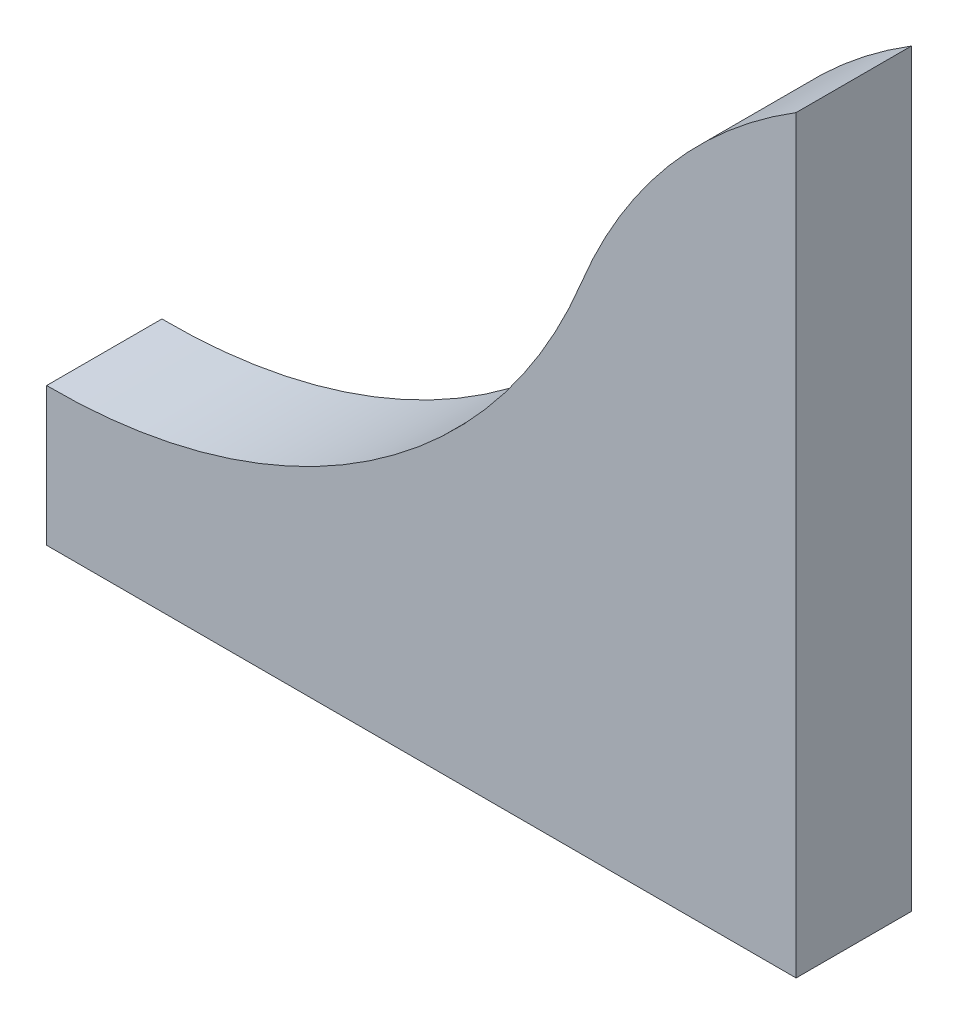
ISO-10303-21;
HEADER;
FILE_DESCRIPTION(('STEP AP214'),'2;1');
FILE_NAME('part.step','',(''),(''),'','','');
FILE_SCHEMA(('AUTOMOTIVE_DESIGN { 1 0 10303 214 1 1 1 1 }'));
ENDSEC;
DATA;
#1=APPLICATION_CONTEXT('core data for automotive mechanical design processes');
#2=APPLICATION_PROTOCOL_DEFINITION('international standard','automotive_design',2000,#1);
#3=PRODUCT_CONTEXT('',#1,'mechanical');
#4=PRODUCT('Part','Part','',(#3));
#5=PRODUCT_RELATED_PRODUCT_CATEGORY('part','',(#4));
#6=PRODUCT_DEFINITION_FORMATION('','',#4);
#7=PRODUCT_DEFINITION_CONTEXT('part definition',#1,'design');
#8=PRODUCT_DEFINITION('design','',#6,#7);
#9=PRODUCT_DEFINITION_SHAPE('','',#8);
#10=(LENGTH_UNIT() NAMED_UNIT(*) SI_UNIT(.MILLI.,.METRE.));
#11=(NAMED_UNIT(*) PLANE_ANGLE_UNIT() SI_UNIT($,.RADIAN.));
#12=(NAMED_UNIT(*) SI_UNIT($,.STERADIAN.) SOLID_ANGLE_UNIT());
#13=UNCERTAINTY_MEASURE_WITH_UNIT(LENGTH_MEASURE(1.E-05),#10,'distance_accuracy_value','');
#14=(GEOMETRIC_REPRESENTATION_CONTEXT(3) GLOBAL_UNCERTAINTY_ASSIGNED_CONTEXT((#13)) GLOBAL_UNIT_ASSIGNED_CONTEXT((#10,
#11,#12)) REPRESENTATION_CONTEXT('',''));
#15=CARTESIAN_POINT('',(0.,0.,0.));
#16=DIRECTION('',(0.,0.,1.));
#17=DIRECTION('',(1.,0.,0.));
#18=AXIS2_PLACEMENT_3D('',#15,#16,#17);
#19=CARTESIAN_POINT('',(-65.,0.,10.));
#20=DIRECTION('',(1.,0.,0.));
#21=DIRECTION('',(0.,0.,-1.));
#22=AXIS2_PLACEMENT_3D('',#19,#20,#21);
#23=PLANE('',#22);
#24=DIRECTION('',(0.,-1.,0.));
#25=VECTOR('',#24,1.);
#26=CARTESIAN_POINT('',(-65.,0.,0.));
#27=LINE('',#26,#25);
#28=CARTESIAN_POINT('',(-65.,12.0002642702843,0.));
#29=VERTEX_POINT('',#28);
#30=CARTESIAN_POINT('',(-65.,0.,0.));
#31=VERTEX_POINT('',#30);
#32=EDGE_CURVE('E104',#29,#31,#27,.T.);
#33=ORIENTED_EDGE('',*,*,#32,.T.);
#34=DIRECTION('',(0.,0.,-1.));
#35=VECTOR('',#34,1.);
#36=CARTESIAN_POINT('',(-65.,0.,10.));
#37=LINE('',#36,#35);
#38=CARTESIAN_POINT('',(-65.,0.,10.));
#39=VERTEX_POINT('',#38);
#40=EDGE_CURVE('E11',#39,#31,#37,.T.);
#41=ORIENTED_EDGE('',*,*,#40,.F.);
#42=DIRECTION('',(0.,-1.,0.));
#43=VECTOR('',#42,1.);
#44=CARTESIAN_POINT('',(-65.,0.,10.));
#45=LINE('',#44,#43);
#46=CARTESIAN_POINT('',(-65.,12.0002642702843,10.));
#47=VERTEX_POINT('',#46);
#48=EDGE_CURVE('E112',#47,#39,#45,.T.);
#49=ORIENTED_EDGE('',*,*,#48,.F.);
#50=DIRECTION('',(0.,0.,-1.));
#51=VECTOR('',#50,1.);
#52=CARTESIAN_POINT('',(-65.,12.0002642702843,10.));
#53=LINE('',#52,#51);
#54=EDGE_CURVE('E100',#47,#29,#53,.T.);
#55=ORIENTED_EDGE('',*,*,#54,.T.);
#56=EDGE_LOOP('',(#33,#41,#49,#55));
#57=FACE_BOUND('',#56,.T.);
#58=ADVANCED_FACE('F30',(#57),#23,.F.);
#59=CARTESIAN_POINT('',(-65.,0.,10.));
#60=DIRECTION('',(0.,1.,0.));
#61=DIRECTION('',(0.,0.,1.));
#62=AXIS2_PLACEMENT_3D('',#59,#60,#61);
#63=PLANE('',#62);
#64=DIRECTION('',(1.,0.,0.));
#65=VECTOR('',#64,1.);
#66=CARTESIAN_POINT('',(-65.,0.,0.));
#67=LINE('',#66,#65);
#68=CARTESIAN_POINT('',(0.,0.,0.));
#69=VERTEX_POINT('',#68);
#70=EDGE_CURVE('E107',#31,#69,#67,.T.);
#71=ORIENTED_EDGE('',*,*,#70,.T.);
#72=DIRECTION('',(0.,0.,-1.));
#73=VECTOR('',#72,1.);
#74=CARTESIAN_POINT('',(0.,0.,10.));
#75=LINE('',#74,#73);
#76=CARTESIAN_POINT('',(0.,0.,10.));
#77=VERTEX_POINT('',#76);
#78=EDGE_CURVE('E38',#77,#69,#75,.T.);
#79=ORIENTED_EDGE('',*,*,#78,.F.);
#80=DIRECTION('',(1.,0.,0.));
#81=VECTOR('',#80,1.);
#82=CARTESIAN_POINT('',(-65.,0.,10.));
#83=LINE('',#82,#81);
#84=EDGE_CURVE('E80',#39,#77,#83,.T.);
#85=ORIENTED_EDGE('',*,*,#84,.F.);
#86=ORIENTED_EDGE('',*,*,#40,.T.);
#87=EDGE_LOOP('',(#71,#79,#85,#86));
#88=FACE_BOUND('',#87,.T.);
#89=ADVANCED_FACE('F131',(#88),#63,.F.);
#90=CARTESIAN_POINT('',(0.,0.,10.));
#91=DIRECTION('',(-1.,0.,0.));
#92=DIRECTION('',(0.,0.,1.));
#93=AXIS2_PLACEMENT_3D('',#90,#91,#92);
#94=PLANE('',#93);
#95=DIRECTION('',(0.,1.,0.));
#96=VECTOR('',#95,1.);
#97=CARTESIAN_POINT('',(0.,0.,0.));
#98=LINE('',#97,#96);
#99=CARTESIAN_POINT('',(0.,65.,0.));
#100=VERTEX_POINT('',#99);
#101=EDGE_CURVE('E95',#69,#100,#98,.T.);
#102=ORIENTED_EDGE('',*,*,#101,.T.);
#103=DIRECTION('',(0.,0.,-1.));
#104=VECTOR('',#103,1.);
#105=CARTESIAN_POINT('',(0.,65.,10.));
#106=LINE('',#105,#104);
#107=CARTESIAN_POINT('',(0.,65.,10.));
#108=VERTEX_POINT('',#107);
#109=EDGE_CURVE('E92',#108,#100,#106,.T.);
#110=ORIENTED_EDGE('',*,*,#109,.F.);
#111=DIRECTION('',(0.,1.,0.));
#112=VECTOR('',#111,1.);
#113=CARTESIAN_POINT('',(0.,0.,10.));
#114=LINE('',#113,#112);
#115=EDGE_CURVE('E84',#77,#108,#114,.T.);
#116=ORIENTED_EDGE('',*,*,#115,.F.);
#117=ORIENTED_EDGE('',*,*,#78,.T.);
#118=EDGE_LOOP('',(#102,#110,#116,#117));
#119=FACE_BOUND('',#118,.T.);
#120=ADVANCED_FACE('F93',(#119),#94,.F.);
#121=CARTESIAN_POINT('',(24.3407578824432,25.5896375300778,10.));
#122=DIRECTION('',(0.,0.,-1.));
#123=DIRECTION('',(-1.,0.,0.));
#124=AXIS2_PLACEMENT_3D('',#121,#122,#123);
#125=CYLINDRICAL_SURFACE('',#124,46.3211524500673);
#126=CARTESIAN_POINT('',(24.3407578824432,25.5896375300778,0.));
#127=DIRECTION('',(0.,0.,1.));
#128=DIRECTION('',(1.,0.,0.));
#129=AXIS2_PLACEMENT_3D('',#126,#127,#128);
#130=CIRCLE('',#129,46.3211524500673);
#131=CARTESIAN_POINT('',(-18.6021503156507,42.9549995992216,0.));
#132=VERTEX_POINT('',#131);
#133=EDGE_CURVE('E66',#100,#132,#130,.T.);
#134=ORIENTED_EDGE('',*,*,#133,.T.);
#135=DIRECTION('',(0.,0.,-1.));
#136=VECTOR('',#135,1.);
#137=CARTESIAN_POINT('',(-18.6021503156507,42.9549995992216,10.));
#138=LINE('',#137,#136);
#139=CARTESIAN_POINT('',(-18.6021503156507,42.9549995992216,10.));
#140=VERTEX_POINT('',#139);
#141=EDGE_CURVE('E96',#140,#132,#138,.T.);
#142=ORIENTED_EDGE('',*,*,#141,.F.);
#143=CARTESIAN_POINT('',(24.3407578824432,25.5896375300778,10.));
#144=DIRECTION('',(0.,0.,1.));
#145=DIRECTION('',(1.,0.,0.));
#146=AXIS2_PLACEMENT_3D('',#143,#144,#145);
#147=CIRCLE('',#146,46.3211524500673);
#148=EDGE_CURVE('E88',#108,#140,#147,.T.);
#149=ORIENTED_EDGE('',*,*,#148,.F.);
#150=ORIENTED_EDGE('',*,*,#109,.T.);
#151=EDGE_LOOP('',(#134,#142,#149,#150));
#152=FACE_BOUND('',#151,.T.);
#153=ADVANCED_FACE('F98',(#152),#125,.T.);
#154=CARTESIAN_POINT('',(-64.5131446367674,61.5206038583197,10.));
#155=DIRECTION('',(0.,0.,-1.));
#156=DIRECTION('',(-1.,0.,0.));
#157=AXIS2_PLACEMENT_3D('',#154,#155,#156);
#158=CYLINDRICAL_SURFACE('',#157,49.5227327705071);
#159=CARTESIAN_POINT('',(-64.5131446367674,61.5206038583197,0.));
#160=DIRECTION('',(0.,0.,-1.));
#161=DIRECTION('',(1.,0.,0.));
#162=AXIS2_PLACEMENT_3D('',#159,#160,#161);
#163=CIRCLE('',#162,49.5227327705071);
#164=EDGE_CURVE('E72',#132,#29,#163,.T.);
#165=ORIENTED_EDGE('',*,*,#164,.T.);
#166=ORIENTED_EDGE('',*,*,#54,.F.);
#167=CARTESIAN_POINT('',(-64.5131446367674,61.5206038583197,10.));
#168=DIRECTION('',(0.,0.,-1.));
#169=DIRECTION('',(1.,0.,0.));
#170=AXIS2_PLACEMENT_3D('',#167,#168,#169);
#171=CIRCLE('',#170,49.5227327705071);
#172=EDGE_CURVE('E46',#140,#47,#171,.T.);
#173=ORIENTED_EDGE('',*,*,#172,.F.);
#174=ORIENTED_EDGE('',*,*,#141,.T.);
#175=EDGE_LOOP('',(#165,#166,#173,#174));
#176=FACE_BOUND('',#175,.T.);
#177=ADVANCED_FACE('F120',(#176),#158,.F.);
#178=CARTESIAN_POINT('',(-64.5131446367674,61.5206038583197,10.));
#179=DIRECTION('',(0.,0.,1.));
#180=DIRECTION('',(1.,0.,0.));
#181=AXIS2_PLACEMENT_3D('',#178,#179,#180);
#182=PLANE('',#181);
#183=ORIENTED_EDGE('',*,*,#48,.T.);
#184=ORIENTED_EDGE('',*,*,#84,.T.);
#185=ORIENTED_EDGE('',*,*,#115,.T.);
#186=ORIENTED_EDGE('',*,*,#148,.T.);
#187=ORIENTED_EDGE('',*,*,#172,.T.);
#188=EDGE_LOOP('',(#183,#184,#185,#186,#187));
#189=FACE_BOUND('',#188,.T.);
#190=ADVANCED_FACE('F86',(#189),#182,.T.);
#191=CARTESIAN_POINT('',(-64.5131446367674,61.5206038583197,0.));
#192=DIRECTION('',(0.,0.,1.));
#193=DIRECTION('',(1.,0.,0.));
#194=AXIS2_PLACEMENT_3D('',#191,#192,#193);
#195=PLANE('',#194);
#196=ORIENTED_EDGE('',*,*,#32,.F.);
#197=ORIENTED_EDGE('',*,*,#164,.F.);
#198=ORIENTED_EDGE('',*,*,#133,.F.);
#199=ORIENTED_EDGE('',*,*,#101,.F.);
#200=ORIENTED_EDGE('',*,*,#70,.F.);
#201=EDGE_LOOP('',(#196,#197,#198,#199,#200));
#202=FACE_BOUND('',#201,.T.);
#203=ADVANCED_FACE('F116',(#202),#195,.F.);
#204=CLOSED_SHELL('',(#58,#89,#120,#153,#177,#190,#203));
#205=MANIFOLD_SOLID_BREP('B2',#204);
#206=ADVANCED_BREP_SHAPE_REPRESENTATION('',(#18,#205),#14);
#207=SHAPE_DEFINITION_REPRESENTATION(#9,#206);
ENDSEC;
END-ISO-10303-21;
